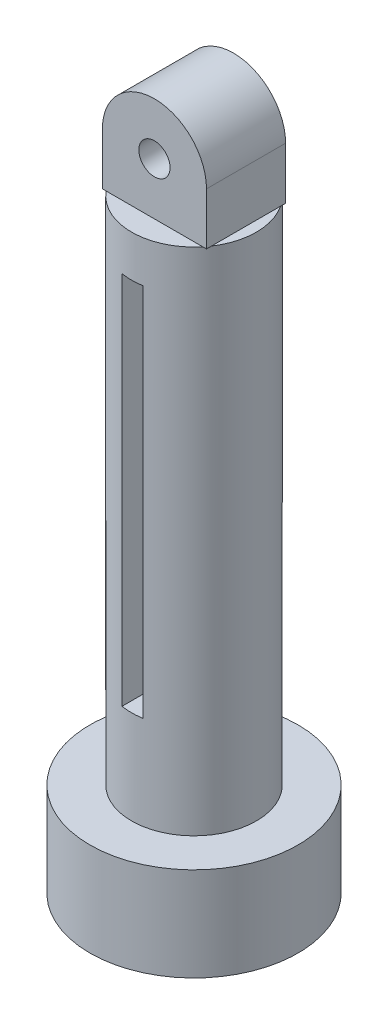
ISO-10303-21;
HEADER;
FILE_DESCRIPTION(('STEP AP214'),'2;1');
FILE_NAME('part.step','',(''),(''),'','','');
FILE_SCHEMA(('AUTOMOTIVE_DESIGN { 1 0 10303 214 1 1 1 1 }'));
ENDSEC;
DATA;
#1=APPLICATION_CONTEXT('core data for automotive mechanical design processes');
#2=APPLICATION_PROTOCOL_DEFINITION('international standard','automotive_design',2000,#1);
#3=PRODUCT_CONTEXT('',#1,'mechanical');
#4=PRODUCT('Part','Part','',(#3));
#5=PRODUCT_RELATED_PRODUCT_CATEGORY('part','',(#4));
#6=PRODUCT_DEFINITION_FORMATION('','',#4);
#7=PRODUCT_DEFINITION_CONTEXT('part definition',#1,'design');
#8=PRODUCT_DEFINITION('design','',#6,#7);
#9=PRODUCT_DEFINITION_SHAPE('','',#8);
#10=(LENGTH_UNIT() NAMED_UNIT(*) SI_UNIT(.MILLI.,.METRE.));
#11=(NAMED_UNIT(*) PLANE_ANGLE_UNIT() SI_UNIT($,.RADIAN.));
#12=(NAMED_UNIT(*) SI_UNIT($,.STERADIAN.) SOLID_ANGLE_UNIT());
#13=UNCERTAINTY_MEASURE_WITH_UNIT(LENGTH_MEASURE(1.E-05),#10,'distance_accuracy_value','');
#14=(GEOMETRIC_REPRESENTATION_CONTEXT(3) GLOBAL_UNCERTAINTY_ASSIGNED_CONTEXT((#13)) GLOBAL_UNIT_ASSIGNED_CONTEXT((#10,
#11,#12)) REPRESENTATION_CONTEXT('',''));
#15=CARTESIAN_POINT('',(0.,0.,0.));
#16=DIRECTION('',(0.,0.,1.));
#17=DIRECTION('',(1.,0.,0.));
#18=AXIS2_PLACEMENT_3D('',#15,#16,#17);
#19=CARTESIAN_POINT('',(-23.3830845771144,26.5671641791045,8.));
#20=DIRECTION('',(1.,0.,0.));
#21=DIRECTION('',(0.,0.,-1.));
#22=AXIS2_PLACEMENT_3D('',#19,#20,#21);
#23=PLANE('',#22);
#24=DIRECTION('',(0.,1.,0.));
#25=VECTOR('',#24,1.);
#26=CARTESIAN_POINT('',(-23.3830845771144,16.5671641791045,0.2));
#27=LINE('',#26,#25);
#28=CARTESIAN_POINT('',(-23.3830845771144,16.5671641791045,0.2));
#29=VERTEX_POINT('',#28);
#30=CARTESIAN_POINT('',(-23.3830845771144,21.5671641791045,0.2));
#31=VERTEX_POINT('',#30);
#32=EDGE_CURVE('E329',#29,#31,#27,.T.);
#33=ORIENTED_EDGE('',*,*,#32,.F.);
#34=DIRECTION('',(0.,0.,-1.));
#35=VECTOR('',#34,1.);
#36=CARTESIAN_POINT('',(-23.3830845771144,16.5671641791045,8.));
#37=LINE('',#36,#35);
#38=CARTESIAN_POINT('',(-23.3830845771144,16.5671641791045,0.683375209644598));
#39=VERTEX_POINT('',#38);
#40=EDGE_CURVE('E247',#39,#29,#37,.T.);
#41=ORIENTED_EDGE('',*,*,#40,.F.);
#42=CARTESIAN_POINT('',(-23.3830845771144,16.5671641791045,7.3166247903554));
#43=VERTEX_POINT('',#42);
#44=EDGE_CURVE('E252',#43,#39,#37,.T.);
#45=ORIENTED_EDGE('',*,*,#44,.F.);
#46=CARTESIAN_POINT('',(-23.3830845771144,16.5671641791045,7.8));
#47=VERTEX_POINT('',#46);
#48=EDGE_CURVE('E249',#47,#43,#37,.T.);
#49=ORIENTED_EDGE('',*,*,#48,.F.);
#50=DIRECTION('',(0.,-1.,0.));
#51=VECTOR('',#50,1.);
#52=CARTESIAN_POINT('',(-23.3830845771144,21.5671641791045,7.8));
#53=LINE('',#52,#51);
#54=CARTESIAN_POINT('',(-23.3830845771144,21.5671641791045,7.8));
#55=VERTEX_POINT('',#54);
#56=EDGE_CURVE('E261',#55,#47,#53,.T.);
#57=ORIENTED_EDGE('',*,*,#56,.F.);
#58=DIRECTION('',(0.,0.,1.));
#59=VECTOR('',#58,1.);
#60=CARTESIAN_POINT('',(-23.3830845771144,21.5671641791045,0.));
#61=LINE('',#60,#59);
#62=EDGE_CURVE('E242',#31,#55,#61,.T.);
#63=ORIENTED_EDGE('',*,*,#62,.F.);
#64=EDGE_LOOP('',(#33,#41,#45,#49,#57,#63));
#65=FACE_BOUND('',#64,.T.);
#66=ADVANCED_FACE('F81',(#65),#23,.F.);
#67=CARTESIAN_POINT('',(-13.3830845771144,26.5671641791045,8.));
#68=DIRECTION('',(-1.,0.,0.));
#69=DIRECTION('',(0.,-1.,0.));
#70=AXIS2_PLACEMENT_3D('',#67,#68,#69);
#71=PLANE('',#70);
#72=DIRECTION('',(0.,-1.,0.));
#73=VECTOR('',#72,1.);
#74=CARTESIAN_POINT('',(-13.3830845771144,21.5671641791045,0.2));
#75=LINE('',#74,#73);
#76=CARTESIAN_POINT('',(-13.3830845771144,21.5671641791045,0.2));
#77=VERTEX_POINT('',#76);
#78=CARTESIAN_POINT('',(-13.3830845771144,16.5671641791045,0.2));
#79=VERTEX_POINT('',#78);
#80=EDGE_CURVE('E323',#77,#79,#75,.T.);
#81=ORIENTED_EDGE('',*,*,#80,.F.);
#82=DIRECTION('',(0.,0.,1.));
#83=VECTOR('',#82,1.);
#84=CARTESIAN_POINT('',(-13.3830845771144,21.5671641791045,0.));
#85=LINE('',#84,#83);
#86=CARTESIAN_POINT('',(-13.3830845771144,21.5671641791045,7.8));
#87=VERTEX_POINT('',#86);
#88=EDGE_CURVE('E238',#77,#87,#85,.T.);
#89=ORIENTED_EDGE('',*,*,#88,.T.);
#90=DIRECTION('',(0.,1.,0.));
#91=VECTOR('',#90,1.);
#92=CARTESIAN_POINT('',(-13.3830845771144,16.5671641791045,7.8));
#93=LINE('',#92,#91);
#94=CARTESIAN_POINT('',(-13.3830845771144,16.5671641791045,7.8));
#95=VERTEX_POINT('',#94);
#96=EDGE_CURVE('E274',#95,#87,#93,.T.);
#97=ORIENTED_EDGE('',*,*,#96,.F.);
#98=DIRECTION('',(0.,0.,-1.));
#99=VECTOR('',#98,1.);
#100=CARTESIAN_POINT('',(-13.3830845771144,16.5671641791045,8.));
#101=LINE('',#100,#99);
#102=CARTESIAN_POINT('',(-13.3830845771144,16.5671641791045,7.3166247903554));
#103=VERTEX_POINT('',#102);
#104=EDGE_CURVE('E245',#95,#103,#101,.T.);
#105=ORIENTED_EDGE('',*,*,#104,.T.);
#106=CARTESIAN_POINT('',(-13.3830845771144,16.5671641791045,0.683375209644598));
#107=VERTEX_POINT('',#106);
#108=EDGE_CURVE('E248',#103,#107,#101,.T.);
#109=ORIENTED_EDGE('',*,*,#108,.T.);
#110=EDGE_CURVE('E244',#107,#79,#101,.T.);
#111=ORIENTED_EDGE('',*,*,#110,.T.);
#112=EDGE_LOOP('',(#81,#89,#97,#105,#109,#111));
#113=FACE_BOUND('',#112,.T.);
#114=ADVANCED_FACE('F395',(#113),#71,.F.);
#115=CARTESIAN_POINT('',(-18.3830845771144,21.5671641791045,0.));
#116=DIRECTION('',(0.,0.,1.));
#117=DIRECTION('',(1.,0.,0.));
#118=AXIS2_PLACEMENT_3D('',#115,#116,#117);
#119=CYLINDRICAL_SURFACE('',#118,5.);
#120=ORIENTED_EDGE('',*,*,#88,.F.);
#121=CARTESIAN_POINT('',(-18.3830845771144,21.5671641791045,0.2));
#122=DIRECTION('',(0.,0.,-1.));
#123=DIRECTION('',(-1.,0.,0.));
#124=AXIS2_PLACEMENT_3D('',#121,#122,#123);
#125=CIRCLE('',#124,5.);
#126=EDGE_CURVE('E321',#31,#77,#125,.T.);
#127=ORIENTED_EDGE('',*,*,#126,.F.);
#128=ORIENTED_EDGE('',*,*,#62,.T.);
#129=CARTESIAN_POINT('',(-18.3830845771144,21.5671641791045,7.8));
#130=DIRECTION('',(0.,0.,1.));
#131=DIRECTION('',(1.,0.,0.));
#132=AXIS2_PLACEMENT_3D('',#129,#130,#131);
#133=CIRCLE('',#132,5.);
#134=EDGE_CURVE('E267',#87,#55,#133,.T.);
#135=ORIENTED_EDGE('',*,*,#134,.F.);
#136=EDGE_LOOP('',(#120,#127,#128,#135));
#137=FACE_BOUND('',#136,.T.);
#138=ADVANCED_FACE('F347',(#137),#119,.T.);
#139=CARTESIAN_POINT('',(-18.3830845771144,21.5671641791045,0.));
#140=DIRECTION('',(0.,0.,1.));
#141=DIRECTION('',(1.,0.,0.));
#142=AXIS2_PLACEMENT_3D('',#139,#140,#141);
#143=CYLINDRICAL_SURFACE('',#142,1.5);
#144=CARTESIAN_POINT('',(-18.3830845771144,21.5671641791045,7.8));
#145=DIRECTION('',(0.,0.,1.));
#146=DIRECTION('',(1.,0.,0.));
#147=AXIS2_PLACEMENT_3D('',#144,#145,#146);
#148=CIRCLE('',#147,1.5);
#149=CARTESIAN_POINT('',(-16.8830845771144,21.5671641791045,7.8));
#150=VERTEX_POINT('',#149);
#151=EDGE_CURVE('E258',#150,#150,#148,.F.);
#152=ORIENTED_EDGE('',*,*,#151,.F.);
#153=EDGE_LOOP('',(#152));
#154=FACE_BOUND('',#153,.T.);
#155=CARTESIAN_POINT('',(-18.3830845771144,21.5671641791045,0.2));
#156=DIRECTION('',(0.,0.,-1.));
#157=DIRECTION('',(-1.,0.,0.));
#158=AXIS2_PLACEMENT_3D('',#155,#156,#157);
#159=CIRCLE('',#158,1.5);
#160=CARTESIAN_POINT('',(-19.8830845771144,21.5671641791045,0.2));
#161=VERTEX_POINT('',#160);
#162=EDGE_CURVE('E331',#161,#161,#159,.F.);
#163=ORIENTED_EDGE('',*,*,#162,.F.);
#164=EDGE_LOOP('',(#163));
#165=FACE_BOUND('',#164,.T.);
#166=ADVANCED_FACE('F403',(#154,#165),#143,.F.);
#167=CARTESIAN_POINT('',(-23.3830845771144,16.5671641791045,8.));
#168=DIRECTION('',(0.,1.,0.));
#169=DIRECTION('',(0.,0.,1.));
#170=AXIS2_PLACEMENT_3D('',#167,#168,#169);
#171=PLANE('',#170);
#172=DIRECTION('',(-1.,0.,0.));
#173=VECTOR('',#172,1.);
#174=CARTESIAN_POINT('',(-13.3830845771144,16.5671641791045,0.2));
#175=LINE('',#174,#173);
#176=CARTESIAN_POINT('',(-13.7398098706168,16.5671641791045,0.2));
#177=VERTEX_POINT('',#176);
#178=EDGE_CURVE('E326',#79,#177,#175,.T.);
#179=ORIENTED_EDGE('',*,*,#178,.F.);
#180=ORIENTED_EDGE('',*,*,#110,.F.);
#181=CARTESIAN_POINT('',(-18.3830845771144,16.5671641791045,4.));
#182=DIRECTION('',(0.,-1.,0.));
#183=DIRECTION('',(0.,0.,-1.));
#184=AXIS2_PLACEMENT_3D('',#181,#182,#183);
#185=CIRCLE('',#184,6.);
#186=EDGE_CURVE('E239',#177,#107,#185,.T.);
#187=ORIENTED_EDGE('',*,*,#186,.F.);
#188=EDGE_LOOP('',(#179,#180,#187));
#189=FACE_BOUND('',#188,.T.);
#190=ADVANCED_FACE('F407',(#189),#171,.F.);
#191=DIRECTION('',(-1.,0.,0.));
#192=VECTOR('',#191,1.);
#193=CARTESIAN_POINT('',(-23.3830845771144,16.5671641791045,0.2));
#194=LINE('',#193,#192);
#195=CARTESIAN_POINT('',(-23.026359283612,16.5671641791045,0.2));
#196=VERTEX_POINT('',#195);
#197=EDGE_CURVE('E12',#196,#29,#194,.T.);
#198=ORIENTED_EDGE('',*,*,#197,.F.);
#199=EDGE_CURVE('E240',#39,#196,#185,.T.);
#200=ORIENTED_EDGE('',*,*,#199,.F.);
#201=ORIENTED_EDGE('',*,*,#40,.T.);
#202=EDGE_LOOP('',(#198,#200,#201));
#203=FACE_BOUND('',#202,.T.);
#204=ADVANCED_FACE('F379',(#203),#171,.F.);
#205=DIRECTION('',(1.,0.,0.));
#206=VECTOR('',#205,1.);
#207=CARTESIAN_POINT('',(-13.9109486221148,16.5671641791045,7.8));
#208=LINE('',#207,#206);
#209=CARTESIAN_POINT('',(-13.7398098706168,16.5671641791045,7.8));
#210=VERTEX_POINT('',#209);
#211=EDGE_CURVE('E334',#210,#95,#208,.T.);
#212=ORIENTED_EDGE('',*,*,#211,.F.);
#213=EDGE_CURVE('E256',#103,#210,#185,.T.);
#214=ORIENTED_EDGE('',*,*,#213,.F.);
#215=ORIENTED_EDGE('',*,*,#104,.F.);
#216=EDGE_LOOP('',(#212,#214,#215));
#217=FACE_BOUND('',#216,.T.);
#218=ADVANCED_FACE('F367',(#217),#171,.F.);
#219=CARTESIAN_POINT('',(-23.026359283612,16.5671641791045,7.8));
#220=VERTEX_POINT('',#219);
#221=EDGE_CURVE('E335',#47,#220,#208,.T.);
#222=ORIENTED_EDGE('',*,*,#221,.F.);
#223=ORIENTED_EDGE('',*,*,#48,.T.);
#224=EDGE_CURVE('E361',#220,#43,#185,.T.);
#225=ORIENTED_EDGE('',*,*,#224,.F.);
#226=EDGE_LOOP('',(#222,#223,#225));
#227=FACE_BOUND('',#226,.T.);
#228=ADVANCED_FACE('F360',(#227),#171,.F.);
#229=CARTESIAN_POINT('',(0.,-36.4328358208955,0.));
#230=DIRECTION('',(0.,-1.,0.));
#231=DIRECTION('',(0.,0.,-1.));
#232=AXIS2_PLACEMENT_3D('',#229,#230,#231);
#233=PLANE('',#232);
#234=CARTESIAN_POINT('',(-18.3830845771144,-36.4328358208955,4.));
#235=DIRECTION('',(0.,-1.,0.));
#236=DIRECTION('',(0.,0.,-1.));
#237=AXIS2_PLACEMENT_3D('',#234,#235,#236);
#238=CIRCLE('',#237,3.25);
#239=CARTESIAN_POINT('',(-18.3830845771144,-36.4328358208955,0.749999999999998));
#240=VERTEX_POINT('',#239);
#241=EDGE_CURVE('E229',#240,#240,#238,.T.);
#242=ORIENTED_EDGE('',*,*,#241,.F.);
#243=EDGE_LOOP('',(#242));
#244=FACE_BOUND('',#243,.T.);
#245=CARTESIAN_POINT('',(-18.3830845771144,-36.4328358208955,4.));
#246=DIRECTION('',(0.,-1.,0.));
#247=DIRECTION('',(0.,0.,-1.));
#248=AXIS2_PLACEMENT_3D('',#245,#246,#247);
#249=CIRCLE('',#248,8.);
#250=CARTESIAN_POINT('',(-18.3830845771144,-36.4328358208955,-4.));
#251=VERTEX_POINT('',#250);
#252=EDGE_CURVE('E88',#251,#251,#249,.F.);
#253=ORIENTED_EDGE('',*,*,#252,.F.);
#254=EDGE_LOOP('',(#253));
#255=FACE_BOUND('',#254,.T.);
#256=ADVANCED_FACE('F417',(#244,#255),#233,.T.);
#257=CARTESIAN_POINT('',(-18.3830845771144,-36.4328358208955,4.));
#258=DIRECTION('',(0.,1.,0.));
#259=DIRECTION('',(0.,0.,1.));
#260=AXIS2_PLACEMENT_3D('',#257,#258,#259);
#261=CYLINDRICAL_SURFACE('',#260,6.);
#262=DIRECTION('',(0.,1.,0.));
#263=VECTOR('',#262,1.);
#264=CARTESIAN_POINT('',(-19.3830845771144,-31.4328358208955,-1.91607978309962));
#265=LINE('',#264,#263);
#266=CARTESIAN_POINT('',(-19.3830845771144,-23.4328358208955,-1.91607978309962));
#267=VERTEX_POINT('',#266);
#268=CARTESIAN_POINT('',(-19.3830845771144,12.5671641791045,-1.91607978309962));
#269=VERTEX_POINT('',#268);
#270=EDGE_CURVE('E95',#267,#269,#265,.T.);
#271=ORIENTED_EDGE('',*,*,#270,.F.);
#272=CARTESIAN_POINT('',(-18.3830845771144,-23.4328358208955,4.));
#273=DIRECTION('',(0.,1.,0.));
#274=DIRECTION('',(0.,0.,1.));
#275=AXIS2_PLACEMENT_3D('',#272,#273,#274);
#276=CIRCLE('',#275,6.);
#277=CARTESIAN_POINT('',(-17.3830845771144,-23.4328358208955,-1.91607978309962));
#278=VERTEX_POINT('',#277);
#279=EDGE_CURVE('E211',#278,#267,#276,.T.);
#280=ORIENTED_EDGE('',*,*,#279,.F.);
#281=DIRECTION('',(0.,1.,0.));
#282=VECTOR('',#281,1.);
#283=CARTESIAN_POINT('',(-17.3830845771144,-31.4328358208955,-1.91607978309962));
#284=LINE('',#283,#282);
#285=CARTESIAN_POINT('',(-17.3830845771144,12.5671641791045,-1.91607978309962));
#286=VERTEX_POINT('',#285);
#287=EDGE_CURVE('E210',#278,#286,#284,.T.);
#288=ORIENTED_EDGE('',*,*,#287,.T.);
#289=CARTESIAN_POINT('',(-18.3830845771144,12.5671641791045,4.));
#290=DIRECTION('',(0.,-1.,0.));
#291=DIRECTION('',(0.,0.,-1.));
#292=AXIS2_PLACEMENT_3D('',#289,#290,#291);
#293=CIRCLE('',#292,6.);
#294=EDGE_CURVE('E222',#269,#286,#293,.T.);
#295=ORIENTED_EDGE('',*,*,#294,.F.);
#296=EDGE_LOOP('',(#271,#280,#288,#295));
#297=FACE_BOUND('',#296,.T.);
#298=CARTESIAN_POINT('',(-18.3830845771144,12.5671641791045,4.));
#299=DIRECTION('',(0.,-1.,0.));
#300=DIRECTION('',(0.,0.,-1.));
#301=AXIS2_PLACEMENT_3D('',#298,#299,#300);
#302=CIRCLE('',#301,6.);
#303=CARTESIAN_POINT('',(-17.3830845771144,12.5671641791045,9.91607978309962));
#304=VERTEX_POINT('',#303);
#305=CARTESIAN_POINT('',(-19.3830845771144,12.5671641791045,9.91607978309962));
#306=VERTEX_POINT('',#305);
#307=EDGE_CURVE('E286',#304,#306,#302,.T.);
#308=ORIENTED_EDGE('',*,*,#307,.F.);
#309=DIRECTION('',(0.,-1.,0.));
#310=VECTOR('',#309,1.);
#311=CARTESIAN_POINT('',(-17.3830845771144,12.5671641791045,9.91607978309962));
#312=LINE('',#311,#310);
#313=CARTESIAN_POINT('',(-17.3830845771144,-23.4328358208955,9.91607978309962));
#314=VERTEX_POINT('',#313);
#315=EDGE_CURVE('E297',#304,#314,#312,.T.);
#316=ORIENTED_EDGE('',*,*,#315,.T.);
#317=CARTESIAN_POINT('',(-18.3830845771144,-23.4328358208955,4.));
#318=DIRECTION('',(0.,1.,0.));
#319=DIRECTION('',(0.,0.,1.));
#320=AXIS2_PLACEMENT_3D('',#317,#318,#319);
#321=CIRCLE('',#320,6.);
#322=CARTESIAN_POINT('',(-19.3830845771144,-23.4328358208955,9.91607978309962));
#323=VERTEX_POINT('',#322);
#324=EDGE_CURVE('E317',#323,#314,#321,.T.);
#325=ORIENTED_EDGE('',*,*,#324,.F.);
#326=DIRECTION('',(0.,-1.,0.));
#327=VECTOR('',#326,1.);
#328=CARTESIAN_POINT('',(-19.3830845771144,12.5671641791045,9.91607978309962));
#329=LINE('',#328,#327);
#330=EDGE_CURVE('E294',#306,#323,#329,.T.);
#331=ORIENTED_EDGE('',*,*,#330,.F.);
#332=EDGE_LOOP('',(#308,#316,#325,#331));
#333=FACE_BOUND('',#332,.T.);
#334=EDGE_CURVE('E235',#196,#177,#185,.T.);
#335=ORIENTED_EDGE('',*,*,#334,.T.);
#336=ORIENTED_EDGE('',*,*,#186,.T.);
#337=EDGE_CURVE('E374',#107,#103,#185,.T.);
#338=ORIENTED_EDGE('',*,*,#337,.T.);
#339=ORIENTED_EDGE('',*,*,#213,.T.);
#340=EDGE_CURVE('E372',#210,#220,#185,.T.);
#341=ORIENTED_EDGE('',*,*,#340,.T.);
#342=ORIENTED_EDGE('',*,*,#224,.T.);
#343=EDGE_CURVE('E231',#43,#39,#185,.T.);
#344=ORIENTED_EDGE('',*,*,#343,.T.);
#345=ORIENTED_EDGE('',*,*,#199,.T.);
#346=EDGE_LOOP('',(#335,#336,#338,#339,#341,#342,#344,#345));
#347=FACE_BOUND('',#346,.T.);
#348=CARTESIAN_POINT('',(-18.3830845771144,-32.4328358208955,4.));
#349=DIRECTION('',(0.,-1.,0.));
#350=DIRECTION('',(0.,0.,-1.));
#351=AXIS2_PLACEMENT_3D('',#348,#349,#350);
#352=CIRCLE('',#351,6.);
#353=CARTESIAN_POINT('',(-18.3830845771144,-32.4328358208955,-2.));
#354=VERTEX_POINT('',#353);
#355=EDGE_CURVE('E253',#354,#354,#352,.T.);
#356=ORIENTED_EDGE('',*,*,#355,.F.);
#357=EDGE_LOOP('',(#356));
#358=FACE_BOUND('',#357,.T.);
#359=ADVANCED_FACE('F308',(#297,#333,#347,#358),#261,.T.);
#360=CARTESIAN_POINT('',(-18.3830845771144,12.5671641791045,4.));
#361=DIRECTION('',(0.,-1.,0.));
#362=DIRECTION('',(0.,0.,-1.));
#363=AXIS2_PLACEMENT_3D('',#360,#361,#362);
#364=CYLINDRICAL_SURFACE('',#363,3.25);
#365=CARTESIAN_POINT('',(-18.3830845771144,-23.4328358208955,4.));
#366=DIRECTION('',(0.,-1.,0.));
#367=DIRECTION('',(0.,0.,1.));
#368=AXIS2_PLACEMENT_3D('',#365,#366,#367);
#369=CIRCLE('',#368,3.25);
#370=CARTESIAN_POINT('',(-19.3830845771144,-23.4328358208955,0.907670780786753));
#371=VERTEX_POINT('',#370);
#372=CARTESIAN_POINT('',(-17.3830845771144,-23.4328358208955,0.907670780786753));
#373=VERTEX_POINT('',#372);
#374=EDGE_CURVE('E194',#371,#373,#369,.T.);
#375=ORIENTED_EDGE('',*,*,#374,.F.);
#376=DIRECTION('',(0.,1.,0.));
#377=VECTOR('',#376,1.);
#378=CARTESIAN_POINT('',(-19.3830845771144,-31.4328358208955,0.907670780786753));
#379=LINE('',#378,#377);
#380=CARTESIAN_POINT('',(-19.3830845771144,12.5671641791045,0.907670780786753));
#381=VERTEX_POINT('',#380);
#382=EDGE_CURVE('E227',#371,#381,#379,.T.);
#383=ORIENTED_EDGE('',*,*,#382,.T.);
#384=CARTESIAN_POINT('',(-18.3830845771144,12.5671641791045,4.));
#385=DIRECTION('',(0.,-1.,0.));
#386=DIRECTION('',(0.,0.,-1.));
#387=AXIS2_PLACEMENT_3D('',#384,#385,#386);
#388=CIRCLE('',#387,3.25);
#389=CARTESIAN_POINT('',(-19.3830845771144,12.5671641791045,7.09232921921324));
#390=VERTEX_POINT('',#389);
#391=EDGE_CURVE('E232',#390,#381,#388,.T.);
#392=ORIENTED_EDGE('',*,*,#391,.F.);
#393=DIRECTION('',(0.,-1.,0.));
#394=VECTOR('',#393,1.);
#395=CARTESIAN_POINT('',(-19.3830845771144,12.5671641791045,7.09232921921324));
#396=LINE('',#395,#394);
#397=CARTESIAN_POINT('',(-19.3830845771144,-23.4328358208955,7.09232921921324));
#398=VERTEX_POINT('',#397);
#399=EDGE_CURVE('E103',#390,#398,#396,.T.);
#400=ORIENTED_EDGE('',*,*,#399,.T.);
#401=CARTESIAN_POINT('',(-18.3830845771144,-23.4328358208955,4.));
#402=DIRECTION('',(0.,-1.,0.));
#403=DIRECTION('',(0.,0.,1.));
#404=AXIS2_PLACEMENT_3D('',#401,#402,#403);
#405=CIRCLE('',#404,3.25);
#406=CARTESIAN_POINT('',(-17.3830845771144,-23.4328358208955,7.09232921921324));
#407=VERTEX_POINT('',#406);
#408=EDGE_CURVE('E311',#407,#398,#405,.T.);
#409=ORIENTED_EDGE('',*,*,#408,.F.);
#410=DIRECTION('',(0.,-1.,0.));
#411=VECTOR('',#410,1.);
#412=CARTESIAN_POINT('',(-17.3830845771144,12.5671641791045,7.09232921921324));
#413=LINE('',#412,#411);
#414=CARTESIAN_POINT('',(-17.3830845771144,12.5671641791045,7.09232921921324));
#415=VERTEX_POINT('',#414);
#416=EDGE_CURVE('E291',#415,#407,#413,.T.);
#417=ORIENTED_EDGE('',*,*,#416,.F.);
#418=CARTESIAN_POINT('',(-17.3830845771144,12.5671641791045,0.907670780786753));
#419=VERTEX_POINT('',#418);
#420=EDGE_CURVE('E218',#419,#415,#388,.T.);
#421=ORIENTED_EDGE('',*,*,#420,.F.);
#422=DIRECTION('',(0.,1.,0.));
#423=VECTOR('',#422,1.);
#424=CARTESIAN_POINT('',(-17.3830845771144,-31.4328358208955,0.907670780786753));
#425=LINE('',#424,#423);
#426=EDGE_CURVE('E208',#373,#419,#425,.T.);
#427=ORIENTED_EDGE('',*,*,#426,.F.);
#428=EDGE_LOOP('',(#375,#383,#392,#400,#409,#417,#421,#427));
#429=FACE_BOUND('',#428,.T.);
#430=ORIENTED_EDGE('',*,*,#241,.T.);
#431=EDGE_LOOP('',(#430));
#432=FACE_BOUND('',#431,.T.);
#433=ADVANCED_FACE('F214',(#429,#432),#364,.F.);
#434=CARTESIAN_POINT('',(0.,16.5671641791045,0.));
#435=DIRECTION('',(0.,-1.,0.));
#436=DIRECTION('',(0.,0.,-1.));
#437=AXIS2_PLACEMENT_3D('',#434,#435,#436);
#438=PLANE('',#437);
#439=ORIENTED_EDGE('',*,*,#334,.F.);
#440=EDGE_CURVE('E325',#177,#196,#175,.T.);
#441=ORIENTED_EDGE('',*,*,#440,.F.);
#442=EDGE_LOOP('',(#439,#441));
#443=FACE_BOUND('',#442,.T.);
#444=ADVANCED_FACE('F390',(#443),#438,.F.);
#445=ORIENTED_EDGE('',*,*,#108,.F.);
#446=ORIENTED_EDGE('',*,*,#337,.F.);
#447=EDGE_LOOP('',(#445,#446));
#448=FACE_BOUND('',#447,.T.);
#449=ADVANCED_FACE('F384',(#448),#438,.F.);
#450=ORIENTED_EDGE('',*,*,#343,.F.);
#451=ORIENTED_EDGE('',*,*,#44,.T.);
#452=EDGE_LOOP('',(#450,#451));
#453=FACE_BOUND('',#452,.T.);
#454=ADVANCED_FACE('F381',(#453),#438,.F.);
#455=ORIENTED_EDGE('',*,*,#340,.F.);
#456=EDGE_CURVE('E336',#220,#210,#208,.T.);
#457=ORIENTED_EDGE('',*,*,#456,.F.);
#458=EDGE_LOOP('',(#455,#457));
#459=FACE_BOUND('',#458,.T.);
#460=ADVANCED_FACE('F383',(#459),#438,.F.);
#461=CARTESIAN_POINT('',(0.,12.5671641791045,0.));
#462=DIRECTION('',(0.,-1.,0.));
#463=DIRECTION('',(0.,0.,-1.));
#464=AXIS2_PLACEMENT_3D('',#461,#462,#463);
#465=PLANE('',#464);
#466=ORIENTED_EDGE('',*,*,#420,.T.);
#467=DIRECTION('',(0.,0.,1.));
#468=VECTOR('',#467,1.);
#469=CARTESIAN_POINT('',(-17.3830845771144,12.5671641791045,0.));
#470=LINE('',#469,#468);
#471=EDGE_CURVE('E283',#415,#304,#470,.T.);
#472=ORIENTED_EDGE('',*,*,#471,.T.);
#473=ORIENTED_EDGE('',*,*,#307,.T.);
#474=DIRECTION('',(0.,0.,1.));
#475=VECTOR('',#474,1.);
#476=CARTESIAN_POINT('',(-19.3830845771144,12.5671641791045,0.));
#477=LINE('',#476,#475);
#478=EDGE_CURVE('E289',#390,#306,#477,.T.);
#479=ORIENTED_EDGE('',*,*,#478,.F.);
#480=ORIENTED_EDGE('',*,*,#391,.T.);
#481=DIRECTION('',(0.,0.,1.));
#482=VECTOR('',#481,1.);
#483=CARTESIAN_POINT('',(-19.3830845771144,12.5671641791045,0.));
#484=LINE('',#483,#482);
#485=EDGE_CURVE('E293',#269,#381,#484,.T.);
#486=ORIENTED_EDGE('',*,*,#485,.F.);
#487=ORIENTED_EDGE('',*,*,#294,.T.);
#488=DIRECTION('',(0.,0.,1.));
#489=VECTOR('',#488,1.);
#490=CARTESIAN_POINT('',(-17.3830845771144,12.5671641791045,0.));
#491=LINE('',#490,#489);
#492=EDGE_CURVE('E219',#286,#419,#491,.T.);
#493=ORIENTED_EDGE('',*,*,#492,.T.);
#494=EDGE_LOOP('',(#466,#472,#473,#479,#480,#486,#487,#493));
#495=FACE_BOUND('',#494,.T.);
#496=ADVANCED_FACE('F305',(#495),#465,.T.);
#497=CARTESIAN_POINT('',(-19.3830845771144,-31.4328358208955,0.));
#498=DIRECTION('',(-1.,0.,0.));
#499=DIRECTION('',(0.,0.,1.));
#500=AXIS2_PLACEMENT_3D('',#497,#498,#499);
#501=PLANE('',#500);
#502=ORIENTED_EDGE('',*,*,#382,.F.);
#503=DIRECTION('',(0.,0.,1.));
#504=VECTOR('',#503,1.);
#505=CARTESIAN_POINT('',(-19.3830845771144,-23.4328358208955,-1.91607978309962));
#506=LINE('',#505,#504);
#507=EDGE_CURVE('E199',#267,#371,#506,.T.);
#508=ORIENTED_EDGE('',*,*,#507,.F.);
#509=ORIENTED_EDGE('',*,*,#270,.T.);
#510=ORIENTED_EDGE('',*,*,#485,.T.);
#511=EDGE_LOOP('',(#502,#508,#509,#510));
#512=FACE_BOUND('',#511,.T.);
#513=ADVANCED_FACE('F479',(#512),#501,.F.);
#514=CARTESIAN_POINT('',(-17.3830845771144,-31.4328358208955,0.));
#515=DIRECTION('',(-1.,0.,0.));
#516=DIRECTION('',(0.,0.,1.));
#517=AXIS2_PLACEMENT_3D('',#514,#515,#516);
#518=PLANE('',#517);
#519=DIRECTION('',(0.,0.,-1.));
#520=VECTOR('',#519,1.);
#521=CARTESIAN_POINT('',(-17.3830845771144,-23.4328358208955,0.907670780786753));
#522=LINE('',#521,#520);
#523=EDGE_CURVE('E197',#373,#278,#522,.T.);
#524=ORIENTED_EDGE('',*,*,#523,.F.);
#525=ORIENTED_EDGE('',*,*,#426,.T.);
#526=ORIENTED_EDGE('',*,*,#492,.F.);
#527=ORIENTED_EDGE('',*,*,#287,.F.);
#528=EDGE_LOOP('',(#524,#525,#526,#527));
#529=FACE_BOUND('',#528,.T.);
#530=ADVANCED_FACE('F206',(#529),#518,.T.);
#531=CARTESIAN_POINT('',(-19.3830845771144,12.5671641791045,0.));
#532=DIRECTION('',(1.,0.,0.));
#533=DIRECTION('',(0.,0.,-1.));
#534=AXIS2_PLACEMENT_3D('',#531,#532,#533);
#535=PLANE('',#534);
#536=DIRECTION('',(0.,0.,1.));
#537=VECTOR('',#536,1.);
#538=CARTESIAN_POINT('',(-19.3830845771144,-23.4328358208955,7.09232921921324));
#539=LINE('',#538,#537);
#540=EDGE_CURVE('E315',#398,#323,#539,.T.);
#541=ORIENTED_EDGE('',*,*,#540,.F.);
#542=ORIENTED_EDGE('',*,*,#399,.F.);
#543=ORIENTED_EDGE('',*,*,#478,.T.);
#544=ORIENTED_EDGE('',*,*,#330,.T.);
#545=EDGE_LOOP('',(#541,#542,#543,#544));
#546=FACE_BOUND('',#545,.T.);
#547=ADVANCED_FACE('F490',(#546),#535,.T.);
#548=CARTESIAN_POINT('',(-17.3830845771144,12.5671641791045,0.));
#549=DIRECTION('',(1.,0.,0.));
#550=DIRECTION('',(0.,0.,-1.));
#551=AXIS2_PLACEMENT_3D('',#548,#549,#550);
#552=PLANE('',#551);
#553=ORIENTED_EDGE('',*,*,#416,.T.);
#554=DIRECTION('',(0.,0.,-1.));
#555=VECTOR('',#554,1.);
#556=CARTESIAN_POINT('',(-17.3830845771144,-23.4328358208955,9.91607978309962));
#557=LINE('',#556,#555);
#558=EDGE_CURVE('E319',#314,#407,#557,.T.);
#559=ORIENTED_EDGE('',*,*,#558,.F.);
#560=ORIENTED_EDGE('',*,*,#315,.F.);
#561=ORIENTED_EDGE('',*,*,#471,.F.);
#562=EDGE_LOOP('',(#553,#559,#560,#561));
#563=FACE_BOUND('',#562,.T.);
#564=ADVANCED_FACE('F497',(#563),#552,.F.);
#565=CARTESIAN_POINT('',(-18.3830845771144,-32.4328358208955,4.));
#566=DIRECTION('',(0.,-1.,0.));
#567=DIRECTION('',(0.,0.,-1.));
#568=AXIS2_PLACEMENT_3D('',#565,#566,#567);
#569=CYLINDRICAL_SURFACE('',#568,10.);
#570=CARTESIAN_POINT('',(-18.3830845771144,-32.4328358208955,4.));
#571=DIRECTION('',(0.,-1.,0.));
#572=DIRECTION('',(0.,0.,-1.));
#573=AXIS2_PLACEMENT_3D('',#570,#571,#572);
#574=CIRCLE('',#573,10.);
#575=CARTESIAN_POINT('',(-18.3830845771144,-32.4328358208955,-6.));
#576=VERTEX_POINT('',#575);
#577=EDGE_CURVE('E280',#576,#576,#574,.T.);
#578=ORIENTED_EDGE('',*,*,#577,.T.);
#579=EDGE_LOOP('',(#578));
#580=FACE_BOUND('',#579,.T.);
#581=CARTESIAN_POINT('',(-18.3830845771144,-41.4328358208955,4.));
#582=DIRECTION('',(0.,-1.,0.));
#583=DIRECTION('',(0.,0.,-1.));
#584=AXIS2_PLACEMENT_3D('',#581,#582,#583);
#585=CIRCLE('',#584,10.);
#586=CARTESIAN_POINT('',(-18.3830845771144,-41.4328358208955,-6.));
#587=VERTEX_POINT('',#586);
#588=EDGE_CURVE('E265',#587,#587,#585,.T.);
#589=ORIENTED_EDGE('',*,*,#588,.F.);
#590=EDGE_LOOP('',(#589));
#591=FACE_BOUND('',#590,.T.);
#592=ADVANCED_FACE('F504',(#580,#591),#569,.T.);
#593=CARTESIAN_POINT('',(0.,-32.4328358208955,0.));
#594=DIRECTION('',(0.,-1.,0.));
#595=DIRECTION('',(0.,0.,-1.));
#596=AXIS2_PLACEMENT_3D('',#593,#594,#595);
#597=PLANE('',#596);
#598=ORIENTED_EDGE('',*,*,#355,.T.);
#599=EDGE_LOOP('',(#598));
#600=FACE_BOUND('',#599,.T.);
#601=ORIENTED_EDGE('',*,*,#577,.F.);
#602=EDGE_LOOP('',(#601));
#603=FACE_BOUND('',#602,.T.);
#604=ADVANCED_FACE('F533',(#600,#603),#597,.F.);
#605=CARTESIAN_POINT('',(-18.3830845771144,-41.4328358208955,4.));
#606=DIRECTION('',(0.,-1.,0.));
#607=DIRECTION('',(0.,0.,-1.));
#608=AXIS2_PLACEMENT_3D('',#605,#606,#607);
#609=PLANE('',#608);
#610=ORIENTED_EDGE('',*,*,#588,.T.);
#611=EDGE_LOOP('',(#610));
#612=FACE_BOUND('',#611,.T.);
#613=CARTESIAN_POINT('',(-18.3830845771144,-41.4328358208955,4.));
#614=DIRECTION('',(0.,-1.,0.));
#615=DIRECTION('',(0.,0.,-1.));
#616=AXIS2_PLACEMENT_3D('',#613,#614,#615);
#617=CIRCLE('',#616,8.);
#618=CARTESIAN_POINT('',(-18.3830845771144,-41.4328358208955,-4.));
#619=VERTEX_POINT('',#618);
#620=EDGE_CURVE('E260',#619,#619,#617,.T.);
#621=ORIENTED_EDGE('',*,*,#620,.F.);
#622=EDGE_LOOP('',(#621));
#623=FACE_BOUND('',#622,.T.);
#624=ADVANCED_FACE('F529',(#612,#623),#609,.T.);
#625=CARTESIAN_POINT('',(-18.3830845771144,-41.4328358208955,4.));
#626=DIRECTION('',(0.,1.,0.));
#627=DIRECTION('',(0.,0.,1.));
#628=AXIS2_PLACEMENT_3D('',#625,#626,#627);
#629=CYLINDRICAL_SURFACE('',#628,8.);
#630=ORIENTED_EDGE('',*,*,#620,.T.);
#631=EDGE_LOOP('',(#630));
#632=FACE_BOUND('',#631,.T.);
#633=ORIENTED_EDGE('',*,*,#252,.T.);
#634=EDGE_LOOP('',(#633));
#635=FACE_BOUND('',#634,.T.);
#636=ADVANCED_FACE('F526',(#632,#635),#629,.F.);
#637=CARTESIAN_POINT('',(-18.3830845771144,21.5671641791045,7.8));
#638=DIRECTION('',(0.,0.,1.));
#639=DIRECTION('',(1.,0.,0.));
#640=AXIS2_PLACEMENT_3D('',#637,#638,#639);
#641=PLANE('',#640);
#642=ORIENTED_EDGE('',*,*,#221,.T.);
#643=ORIENTED_EDGE('',*,*,#456,.T.);
#644=ORIENTED_EDGE('',*,*,#211,.T.);
#645=ORIENTED_EDGE('',*,*,#96,.T.);
#646=ORIENTED_EDGE('',*,*,#134,.T.);
#647=ORIENTED_EDGE('',*,*,#56,.T.);
#648=EDGE_LOOP('',(#642,#643,#644,#645,#646,#647));
#649=FACE_BOUND('',#648,.T.);
#650=ORIENTED_EDGE('',*,*,#151,.T.);
#651=EDGE_LOOP('',(#650));
#652=FACE_BOUND('',#651,.T.);
#653=ADVANCED_FACE('F340',(#649,#652),#641,.T.);
#654=CARTESIAN_POINT('',(-18.3830845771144,21.5671641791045,0.2));
#655=DIRECTION('',(0.,0.,-1.));
#656=DIRECTION('',(-1.,0.,0.));
#657=AXIS2_PLACEMENT_3D('',#654,#655,#656);
#658=PLANE('',#657);
#659=ORIENTED_EDGE('',*,*,#126,.T.);
#660=ORIENTED_EDGE('',*,*,#80,.T.);
#661=ORIENTED_EDGE('',*,*,#178,.T.);
#662=ORIENTED_EDGE('',*,*,#440,.T.);
#663=ORIENTED_EDGE('',*,*,#197,.T.);
#664=ORIENTED_EDGE('',*,*,#32,.T.);
#665=EDGE_LOOP('',(#659,#660,#661,#662,#663,#664));
#666=FACE_BOUND('',#665,.T.);
#667=ORIENTED_EDGE('',*,*,#162,.T.);
#668=EDGE_LOOP('',(#667));
#669=FACE_BOUND('',#668,.T.);
#670=ADVANCED_FACE('F449',(#666,#669),#658,.T.);
#671=CARTESIAN_POINT('',(-18.3830845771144,-23.4328358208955,4.));
#672=DIRECTION('',(0.,1.,0.));
#673=DIRECTION('',(0.,0.,1.));
#674=AXIS2_PLACEMENT_3D('',#671,#672,#673);
#675=PLANE('',#674);
#676=ORIENTED_EDGE('',*,*,#408,.T.);
#677=ORIENTED_EDGE('',*,*,#540,.T.);
#678=ORIENTED_EDGE('',*,*,#324,.T.);
#679=ORIENTED_EDGE('',*,*,#558,.T.);
#680=EDGE_LOOP('',(#676,#677,#678,#679));
#681=FACE_BOUND('',#680,.T.);
#682=ADVANCED_FACE('F453',(#681),#675,.T.);
#683=CARTESIAN_POINT('',(-18.3830845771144,-23.4328358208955,4.));
#684=DIRECTION('',(0.,1.,0.));
#685=DIRECTION('',(0.,0.,1.));
#686=AXIS2_PLACEMENT_3D('',#683,#684,#685);
#687=PLANE('',#686);
#688=ORIENTED_EDGE('',*,*,#374,.T.);
#689=ORIENTED_EDGE('',*,*,#523,.T.);
#690=ORIENTED_EDGE('',*,*,#279,.T.);
#691=ORIENTED_EDGE('',*,*,#507,.T.);
#692=EDGE_LOOP('',(#688,#689,#690,#691));
#693=FACE_BOUND('',#692,.T.);
#694=ADVANCED_FACE('F196',(#693),#687,.T.);
#695=CLOSED_SHELL('',(#66,#114,#138,#166,#190,#204,#218,#228,#256,#359,#433,#444,#449,#454,#460,
#496,#513,#530,#547,#564,#592,#604,#624,#636,#653,#670,#682,#694));
#696=MANIFOLD_SOLID_BREP('B2',#695);
#697=ADVANCED_BREP_SHAPE_REPRESENTATION('',(#18,#696),#14);
#698=SHAPE_DEFINITION_REPRESENTATION(#9,#697);
ENDSEC;
END-ISO-10303-21;
